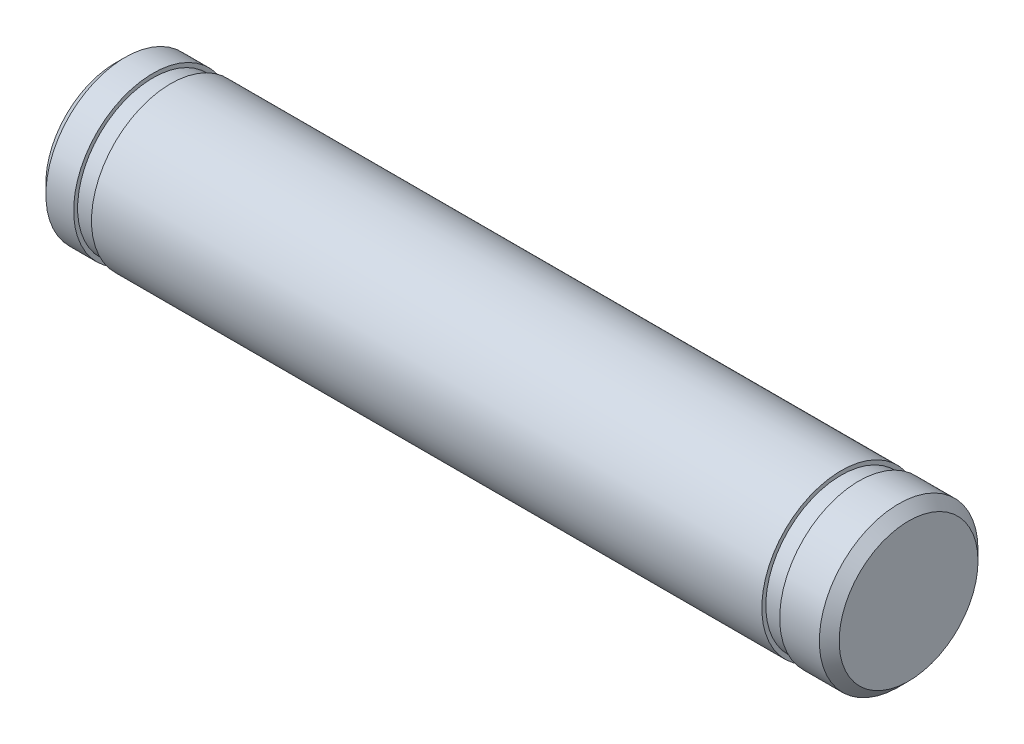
from build123d import *


with BuildPart() as part:
    # Esquisse1 → R_volution1 (revolve)
    with BuildSketch(Plane.XY, mode=Mode.PRIVATE) as r_volution1_sk:
        Polygon((0, 0), (40, 0), (40, 3.5), (39.5, 4), (37.5, 4), (37.5, 3.8), (36.6, 3.8), (36.6, 4), (2.8, 4), (2.8, 3.8), (1.9, 3.8), (1.9, 4), (0.5, 4), (0, 3.5), align=None)
    revolve(r_volution1_sk.sketch.rotate(Axis((124.297135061, 0, 0), (-1, 0, 0)), 90), axis=Axis((124.297135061, 0, 0), (-1, 0, 0)))


solid = part.part
